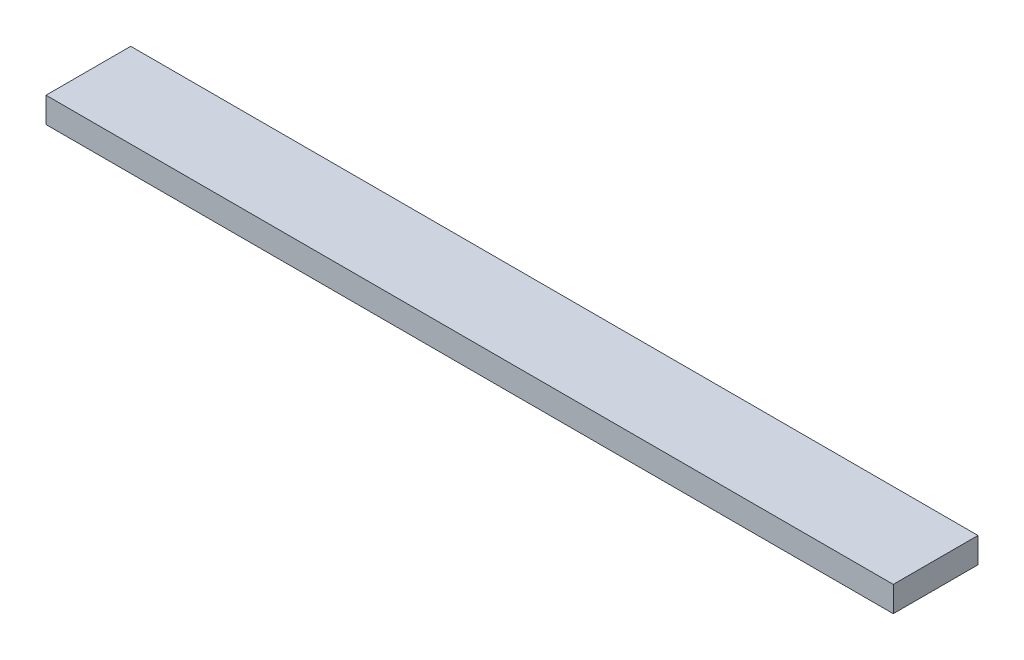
from build123d import *

# Parameters (mm, degrees)
SKIZZE1_W               = 50
SKIZZE1_H               = 15
LINEAR_AUSTRAGEN1_DEPTH = 500


with BuildPart() as part:
    # Skizze1 → Linear austragen1 (new body)
    with BuildSketch(Plane(origin=(0, 0, 0), x_dir=(0, 0, -1), z_dir=(1, 0, 0))):
        with Locations((25, 7.5)):
            Rectangle(SKIZZE1_W, SKIZZE1_H)
    extrude(amount=LINEAR_AUSTRAGEN1_DEPTH)


solid = part.part
